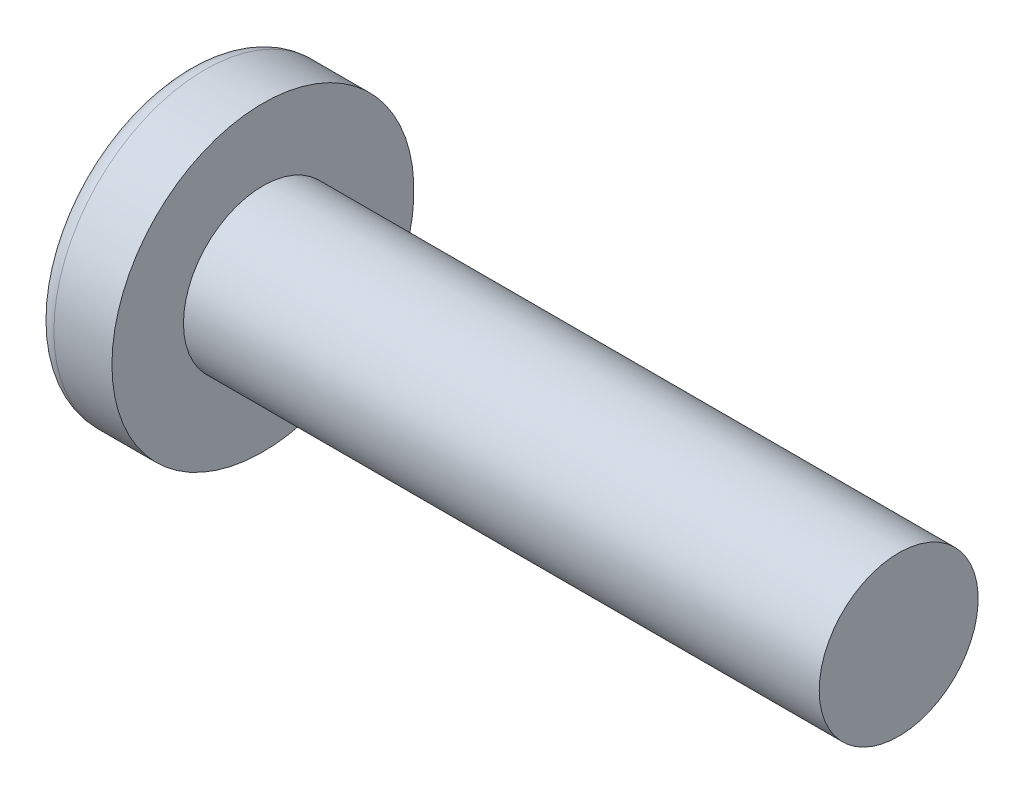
from build123d import *

# Parameters (mm, degrees)
CIRPATTERN1_COUNT = 2
CIRPATTERN1_ANGLE = 90


with BuildPart() as part:
    # BodySke → Base-Revolve (revolve)
    with BuildSketch(Plane.XY, mode=Mode.PRIVATE) as base_revolve_sk:
        with BuildLine():
            Line((3.7, 2.5), (3.7, 4.75))
            Line((3.7, 4.75), (1.873214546, 4.75))
            ThreePointArc((1.873214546, 4.75), (1.592049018, 4.680043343), (1.376448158, 4.486486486))
            ThreePointArc((1.376448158, 4.486486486), (0.351849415, 2.346442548), (0, 0))
            Line((0, 0), (23.7, 0))
            Line((23.7, 0), (23.7, 2.5))
            Line((23.7, 2.5), (3.7, 2.5))
        make_face()
    revolve(base_revolve_sk.sketch.rotate(Axis((-25.4, 0, 0), (1, 0, 0)), 90), axis=Axis((-25.4, 0, 0), (1, 0, 0)))

    # Sketch3 → Cut-Loft1 section 0
    with BuildSketch(Plane(origin=(0, 0, 0), x_dir=(0, 0, -1), z_dir=(1, 0, 0))):
        with BuildLine():
            Line((0.5, -2.45), (-0.5, -2.45))
            Line((-0.5, -2.45), (-0.5, 2.45))
            Line((-0.5, 2.45), (0.5, 2.45))
            Line((0.5, 2.45), (0.5, -2.45))
        make_face()
    # Sketch4 → Cut-Loft1 section 1
    with BuildSketch(Plane(origin=(2.95, 0, 0), x_dir=(0, 0, -1), z_dir=(1, 0, 0))):
        with BuildLine():
            Line((0.25, -0.25), (-0.25, -0.25))
            Line((-0.25, -0.25), (-0.25, 0.25))
            Line((-0.25, 0.25), (0.25, 0.25))
            Line((0.25, 0.25), (0.25, -0.25))
        make_face()
    cut_loft1 = loft(mode=Mode.SUBTRACT)

    # CirPattern1: Cut-Loft1 ×2 about axis
    cirpattern1_axis = Axis((0, 0, 0), (1, 0, 0))
    for i in range(1, CIRPATTERN1_COUNT):
        add(cut_loft1.rotate(cirpattern1_axis, i * CIRPATTERN1_ANGLE / (CIRPATTERN1_COUNT - 1)), mode=Mode.SUBTRACT)


solid = part.part
